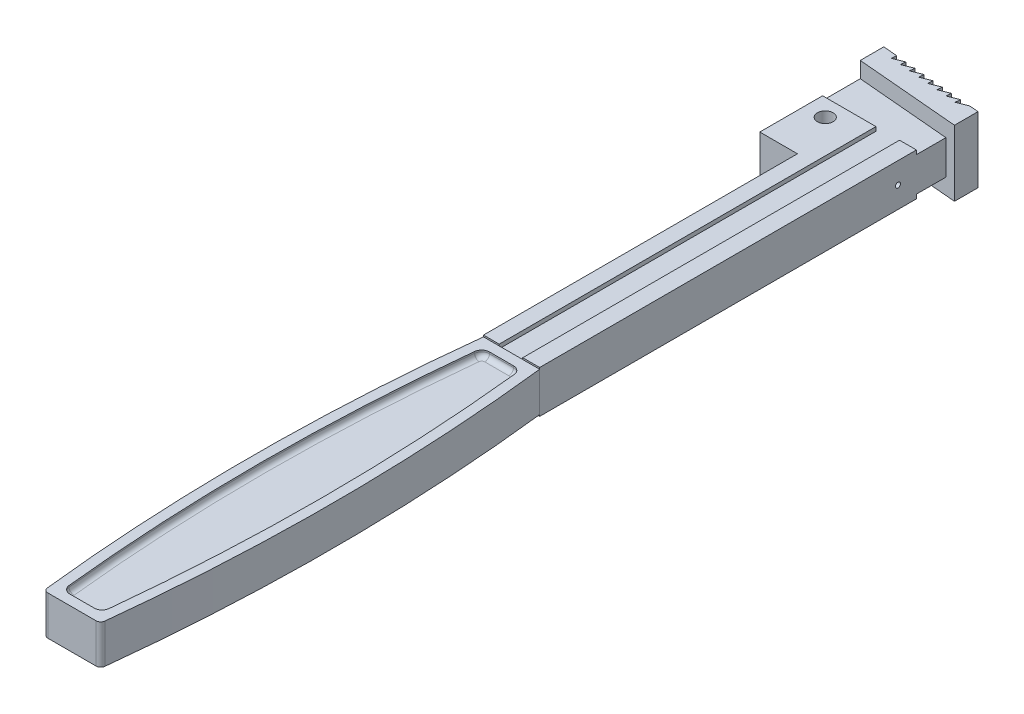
from build123d import *

# Parameters (mm, degrees)
BOSS_EXTRUDE1_DEPTH       = 6.25
BOSS_EXTRUDE2_DEPTH       = 10.5
CUT_EXTRUDE1_DEPTH        = 282.06913014
LPATTERN1_COUNT           = 8
LPATTERN1_PITCH           = 3.2
CUT_EXTRUDE2_DEPTH        = 0.8
SKETCH6_W                 = 7.5
SKETCH6_H                 = 120
CUT_EXTRUDE3_DEPTH        = 0.8
CUT_EXTRUDE4_DEPTH        = 2
SKETCH8_W                 = 5.385840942
SKETCH8_H                 = 120
BOSS_EXTRUDE3_DEPTH       = 0.5
FILLET1_R                 = 2.5
FILLET2_R                 = 2.5
SKETCH9_R                 = 2.5
CUT_EXTRUDE5_DEPTH        = 281.813850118
FILLET3_R                 = 1.5
FILLET4_R                 = 1.5
M2X0_4_TAPPED_HOLE1_D     = 1.6
M2X0_4_TAPPED_HOLE1_DEPTH = 5.2
M2X0_4_TAPPED_HOLE1_TIP   = 0.480688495
M2X0_4_TAPPED_HOLE2_D     = 1.6
M2X0_4_TAPPED_HOLE2_DEPTH = 5.2
M2X0_4_TAPPED_HOLE2_TIP   = 0.480688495


with BuildPart() as part:
    # Sketch1 → Boss-Extrude1 (new, symmetric)
    with BuildSketch(Plane(origin=(0, 0, 0), x_dir=(1, 0, 0), z_dir=(0, 1, 0))):
        with BuildLine():
            Line((-9, 0), (9, 0))
            ThreePointArc((9, 0), (12.922918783, 70.001611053), (8.942920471, 140))
            Line((8.942920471, 140), (8.942920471, 269.385327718))
            Line((8.942920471, 269.385327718), (-20.942920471, 272))
            Line((-20.942920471, 272), (-20.942920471, 240))
            Line((-20.942920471, 240), (-8.942920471, 240))
            Line((-8.942920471, 240), (-8.942920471, 140))
            ThreePointArc((-8.942920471, 140), (-12.922918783, 70.001611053), (-9, 0))
        make_face()
    extrude(amount=BOSS_EXTRUDE1_DEPTH, both=True)

    # Sketch2 → Boss-Extrude2 (add, symmetric)
    with BuildSketch(Plane(origin=(0, 0, 0), x_dir=(1, 0, 0), z_dir=(0, 1, 0))):
        Polygon((-20.942920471, 279.5), (11.931504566, 276.623860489), (11.931504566, 269.123860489), (-20.942920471, 272), align=None)
    extrude(amount=BOSS_EXTRUDE2_DEPTH, both=True)

    # Sketch3 → Cut-Extrude1 (cut, through all)
    with BuildSketch(Plane(origin=(0, 10.5, 0), x_dir=(1, 0, 0), z_dir=(0, 1, 0))):
        Polygon((-16.46004433, 279.107799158), (-16.59951095, 277.513688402), (-13.272221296, 278.828900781), align=None)
    cut_extrude1 = extrude(amount=-CUT_EXTRUDE1_DEPTH, mode=Mode.SUBTRACT)

    # LPattern1: Cut-Extrude1 ×8
    with Locations(*[Vector(0.9961946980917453, 0, 0.08715574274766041) * (i * LPATTERN1_PITCH) for i in range(1, LPATTERN1_COUNT)]):
        add(cut_extrude1, mode=Mode.SUBTRACT)

    # Sketch4 → Cut-Extrude2 (cut)
    with BuildSketch(Plane(origin=(0, 6.25, 0), x_dir=(1, 0, 0), z_dir=(0, 1, 0))):
        Polygon((-20.942920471, 260), (8.942920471, 260), (8.942920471, 269.385327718), (-20.942920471, 272), align=None)
    cut_extrude2 = extrude(amount=-CUT_EXTRUDE2_DEPTH, mode=Mode.SUBTRACT)

    # Sketch6 → Cut-Extrude3 (cut)
    with BuildSketch(Plane(origin=(0, 6.25, 0), x_dir=(1, 0, 0), z_dir=(0, 1, 0))):
        with Locations((-0.192920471, 200)):
            Rectangle(SKETCH6_W, SKETCH6_H)
    cut_extrude3 = extrude(amount=-CUT_EXTRUDE3_DEPTH, mode=Mode.SUBTRACT)

    # Sketch7 → Cut-Extrude4 (cut)
    with BuildSketch(Plane(origin=(0, 6.25, 0), x_dir=(1, 0, 0), z_dir=(0, 1, 0))):
        with BuildLine():
            Line((-6.134155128, 3.2), (6.134155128, 3.2))
            ThreePointArc((6.134155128, 3.2), (9.722918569, 70.001481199), (6.079431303, 136.8))
            Line((6.079431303, 136.8), (-6.079431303, 136.8))
            ThreePointArc((-6.079431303, 136.8), (-9.722918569, 70.001481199), (-6.134155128, 3.2))
        make_face()
    cut_extrude4 = extrude(amount=-CUT_EXTRUDE4_DEPTH, mode=Mode.SUBTRACT)

    # Sketch8 → Boss-Extrude3 (add)
    with BuildSketch(Plane(origin=(0, 6.25, 0), x_dir=(1, 0, 0), z_dir=(0, 1, 0))):
        Polygon((-8.942920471, 140), (-3.942920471, 140), (-3.942920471, 260), (-20.942920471, 260), (-20.942920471, 240), (-8.942920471, 240), align=None)
        with Locations((6.25, 200)):
            Rectangle(SKETCH8_W, SKETCH8_H)
    boss_extrude3 = extrude(amount=BOSS_EXTRUDE3_DEPTH)

    # Mirror1: Cut-Extrude2, Cut-Extrude3, Cut-Extrude4, Boss-Extrude3 across plane
    add(cut_extrude2.mirror(Plane.ZX), mode=Mode.SUBTRACT)
    add(cut_extrude3.mirror(Plane.ZX), mode=Mode.SUBTRACT)
    add(cut_extrude4.mirror(Plane.ZX), mode=Mode.SUBTRACT)
    add(boss_extrude3.mirror(Plane.ZX))

    # Fillet1
    fillet1_edges = [part.edges().sort_by_distance(p)[0] for p in [
        (-6.134155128, 5.25, -3.2),
        (-6.079431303, 5.25, -136.8),
        (6.079431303, 5.25, -136.8),
        (6.134155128, 5.25, -3.2),
    ]]
    fillet(fillet1_edges, radius=FILLET1_R)

    # Fillet2
    fillet2_edges = [part.edges().sort_by_distance(p)[0] for p in [
        (-6.079431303, -5.25, -136.8),
        (-6.134155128, -5.25, -3.2),
        (6.134155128, -5.25, -3.2),
        (6.079431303, -5.25, -136.8),
    ]]
    fillet(fillet2_edges, radius=FILLET2_R)

    # Sketch9 → Cut-Extrude5 (cut, through all)
    with BuildSketch(Plane(origin=(0, 6.75, 0), x_dir=(1, 0, 0), z_dir=(0, 1, 0))):
        with Locations(Location((-14.592920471, 254.5, 0), (0, 0, 270))):
            Circle(SKETCH9_R)
    extrude(amount=-CUT_EXTRUDE5_DEPTH, mode=Mode.SUBTRACT)

    # Fillet3
    fillet3_edges = [part.edges().sort_by_distance(p)[0] for p in [
        (9.722918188, 4.25, -70.002410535),
        (0, 4.25, -3.2),
        (-9.722918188, 4.25, -70.002410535),
        (0, 4.25, -136.8),
        (-5.505649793, 4.25, -136.158040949),
        (-5.559282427, 4.25, -3.842646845),
        (5.505649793, 4.25, -136.158040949),
        (5.559282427, 4.25, -3.842646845),
        (0, -4.25, -136.8),
        (-9.722918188, -4.25, -70.002410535),
        (9.722918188, -4.25, -70.002410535),
        (0, -4.25, -3.2),
        (5.505649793, -4.25, -136.158040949),
        (-5.559282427, -4.25, -3.842646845),
        (5.559282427, -4.25, -3.842646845),
        (-5.505649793, -4.25, -136.158040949),
    ]]
    fillet(fillet3_edges, radius=FILLET3_R)

    # Fillet4
    fillet4_edges = [part.edges().sort_by_distance(p)[0] for p in [
        (9, 0, 0),
        (-9, 0, 0),
    ]]
    fillet(fillet4_edges, radius=FILLET4_R)

    # M2x0.4 Tapped Hole1
    with Locations(Plane(origin=(8.942920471, 0, -254.123860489), x_dir=(0, 0, 1), z_dir=(1, 0, 0))):
        with Locations((0, 0)):
            Hole(M2X0_4_TAPPED_HOLE1_D / 2, depth=M2X0_4_TAPPED_HOLE1_DEPTH)
            with Locations((0, 0, -(M2X0_4_TAPPED_HOLE1_DEPTH + M2X0_4_TAPPED_HOLE1_TIP / 2))):  # 118° drill point
                Cone(0, M2X0_4_TAPPED_HOLE1_D / 2, M2X0_4_TAPPED_HOLE1_TIP, mode=Mode.SUBTRACT)

    # M2x0.4 Tapped Hole2
    with Locations(Plane(origin=(-8.942920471, 0, -175), x_dir=(0, 0, -1), z_dir=(-1, 0, 0))):
        with Locations((0, 0)):
            Hole(M2X0_4_TAPPED_HOLE2_D / 2, depth=M2X0_4_TAPPED_HOLE2_DEPTH)
            with Locations((0, 0, -(M2X0_4_TAPPED_HOLE2_DEPTH + M2X0_4_TAPPED_HOLE2_TIP / 2))):  # 118° drill point
                Cone(0, M2X0_4_TAPPED_HOLE2_D / 2, M2X0_4_TAPPED_HOLE2_TIP, mode=Mode.SUBTRACT)


solid = part.part
